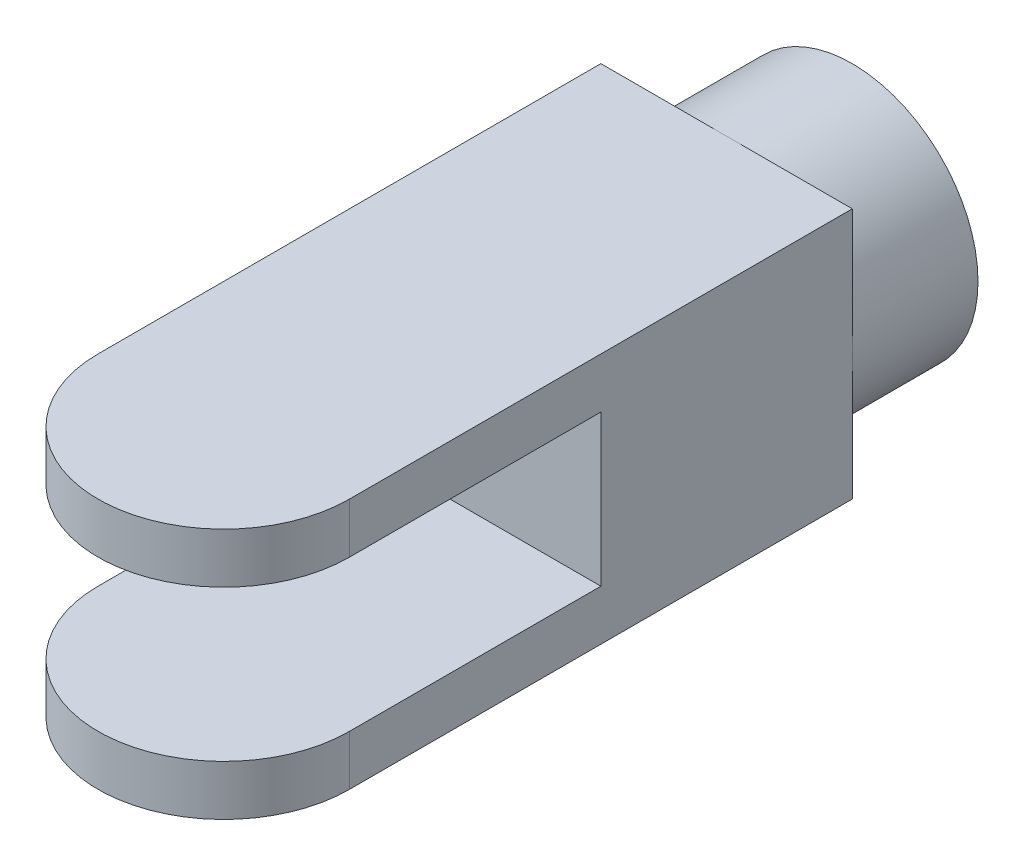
ISO-10303-21;
HEADER;
FILE_DESCRIPTION(('STEP AP214'),'2;1');
FILE_NAME('part.step','',(''),(''),'','','');
FILE_SCHEMA(('AUTOMOTIVE_DESIGN { 1 0 10303 214 1 1 1 1 }'));
ENDSEC;
DATA;
#1=APPLICATION_CONTEXT('core data for automotive mechanical design processes');
#2=APPLICATION_PROTOCOL_DEFINITION('international standard','automotive_design',2000,#1);
#3=PRODUCT_CONTEXT('',#1,'mechanical');
#4=PRODUCT('Part','Part','',(#3));
#5=PRODUCT_RELATED_PRODUCT_CATEGORY('part','',(#4));
#6=PRODUCT_DEFINITION_FORMATION('','',#4);
#7=PRODUCT_DEFINITION_CONTEXT('part definition',#1,'design');
#8=PRODUCT_DEFINITION('design','',#6,#7);
#9=PRODUCT_DEFINITION_SHAPE('','',#8);
#10=(LENGTH_UNIT() NAMED_UNIT(*) SI_UNIT(.MILLI.,.METRE.));
#11=(NAMED_UNIT(*) PLANE_ANGLE_UNIT() SI_UNIT($,.RADIAN.));
#12=(NAMED_UNIT(*) SI_UNIT($,.STERADIAN.) SOLID_ANGLE_UNIT());
#13=UNCERTAINTY_MEASURE_WITH_UNIT(LENGTH_MEASURE(1.E-05),#10,'distance_accuracy_value','');
#14=(GEOMETRIC_REPRESENTATION_CONTEXT(3) GLOBAL_UNCERTAINTY_ASSIGNED_CONTEXT((#13)) GLOBAL_UNIT_ASSIGNED_CONTEXT((#10,
#11,#12)) REPRESENTATION_CONTEXT('',''));
#15=CARTESIAN_POINT('',(0.,0.,0.));
#16=DIRECTION('',(0.,0.,1.));
#17=DIRECTION('',(1.,0.,0.));
#18=AXIS2_PLACEMENT_3D('',#15,#16,#17);
#19=CARTESIAN_POINT('',(0.,-50.,250.));
#20=DIRECTION('',(0.,1.,0.));
#21=DIRECTION('',(0.,0.,1.));
#22=AXIS2_PLACEMENT_3D('',#19,#20,#21);
#23=CYLINDRICAL_SURFACE('',#22,50.);
#24=CARTESIAN_POINT('',(0.,30.,250.));
#25=DIRECTION('',(0.,1.,0.));
#26=DIRECTION('',(0.,0.,1.));
#27=AXIS2_PLACEMENT_3D('',#24,#25,#26);
#28=CIRCLE('',#27,50.);
#29=CARTESIAN_POINT('',(50.,30.,250.));
#30=VERTEX_POINT('',#29);
#31=CARTESIAN_POINT('',(-50.,30.,250.));
#32=VERTEX_POINT('',#31);
#33=EDGE_CURVE('E121',#30,#32,#28,.F.);
#34=ORIENTED_EDGE('',*,*,#33,.F.);
#35=DIRECTION('',(0.,1.,0.));
#36=VECTOR('',#35,1.);
#37=CARTESIAN_POINT('',(50.,-50.,250.));
#38=LINE('',#37,#36);
#39=CARTESIAN_POINT('',(50.,50.,250.));
#40=VERTEX_POINT('',#39);
#41=EDGE_CURVE('E173',#30,#40,#38,.T.);
#42=ORIENTED_EDGE('',*,*,#41,.T.);
#43=CARTESIAN_POINT('',(0.,50.,250.));
#44=DIRECTION('',(0.,1.,0.));
#45=DIRECTION('',(0.,0.,1.));
#46=AXIS2_PLACEMENT_3D('',#43,#44,#45);
#47=CIRCLE('',#46,50.);
#48=CARTESIAN_POINT('',(-50.,50.,250.));
#49=VERTEX_POINT('',#48);
#50=EDGE_CURVE('E145',#49,#40,#47,.T.);
#51=ORIENTED_EDGE('',*,*,#50,.F.);
#52=DIRECTION('',(0.,1.,0.));
#53=VECTOR('',#52,1.);
#54=CARTESIAN_POINT('',(-50.,-50.,250.));
#55=LINE('',#54,#53);
#56=EDGE_CURVE('E176',#32,#49,#55,.T.);
#57=ORIENTED_EDGE('',*,*,#56,.F.);
#58=EDGE_LOOP('',(#34,#42,#51,#57));
#59=FACE_BOUND('',#58,.T.);
#60=ADVANCED_FACE('F32',(#59),#23,.T.);
#61=CARTESIAN_POINT('',(0.,0.,50.));
#62=DIRECTION('',(0.,0.,-1.));
#63=DIRECTION('',(-1.,0.,0.));
#64=AXIS2_PLACEMENT_3D('',#61,#62,#63);
#65=CYLINDRICAL_SURFACE('',#64,50.);
#66=CARTESIAN_POINT('',(0.,0.,50.));
#67=DIRECTION('',(0.,0.,1.));
#68=DIRECTION('',(1.,0.,0.));
#69=AXIS2_PLACEMENT_3D('',#66,#67,#68);
#70=CIRCLE('',#69,50.);
#71=CARTESIAN_POINT('',(50.,0.,50.));
#72=VERTEX_POINT('',#71);
#73=CARTESIAN_POINT('',(0.,50.,50.));
#74=VERTEX_POINT('',#73);
#75=EDGE_CURVE('E40',#72,#74,#70,.T.);
#76=ORIENTED_EDGE('',*,*,#75,.F.);
#77=CARTESIAN_POINT('',(0.,-50.,50.));
#78=VERTEX_POINT('',#77);
#79=EDGE_CURVE('E55',#78,#72,#70,.T.);
#80=ORIENTED_EDGE('',*,*,#79,.F.);
#81=CARTESIAN_POINT('',(-50.,0.,50.));
#82=VERTEX_POINT('',#81);
#83=EDGE_CURVE('E185',#82,#78,#70,.T.);
#84=ORIENTED_EDGE('',*,*,#83,.F.);
#85=EDGE_CURVE('E181',#74,#82,#70,.T.);
#86=ORIENTED_EDGE('',*,*,#85,.F.);
#87=EDGE_LOOP('',(#76,#80,#84,#86));
#88=FACE_BOUND('',#87,.T.);
#89=CARTESIAN_POINT('',(0.,0.,0.));
#90=DIRECTION('',(0.,0.,1.));
#91=DIRECTION('',(1.,0.,0.));
#92=AXIS2_PLACEMENT_3D('',#89,#90,#91);
#93=CIRCLE('',#92,50.);
#94=CARTESIAN_POINT('',(50.,0.,0.));
#95=VERTEX_POINT('',#94);
#96=EDGE_CURVE('E168',#95,#95,#93,.T.);
#97=ORIENTED_EDGE('',*,*,#96,.T.);
#98=EDGE_LOOP('',(#97));
#99=FACE_BOUND('',#98,.T.);
#100=ADVANCED_FACE('F34',(#88,#99),#65,.T.);
#101=CARTESIAN_POINT('',(0.,0.,0.));
#102=DIRECTION('',(0.,0.,1.));
#103=DIRECTION('',(1.,0.,0.));
#104=AXIS2_PLACEMENT_3D('',#101,#102,#103);
#105=PLANE('',#104);
#106=ORIENTED_EDGE('',*,*,#96,.F.);
#107=EDGE_LOOP('',(#106));
#108=FACE_BOUND('',#107,.T.);
#109=ADVANCED_FACE('F224',(#108),#105,.F.);
#110=CARTESIAN_POINT('',(-50.,-50.,50.));
#111=DIRECTION('',(0.,0.,-1.));
#112=DIRECTION('',(-1.,0.,0.));
#113=AXIS2_PLACEMENT_3D('',#110,#111,#112);
#114=PLANE('',#113);
#115=DIRECTION('',(0.,1.,0.));
#116=VECTOR('',#115,1.);
#117=CARTESIAN_POINT('',(50.,-50.,50.));
#118=LINE('',#117,#116);
#119=CARTESIAN_POINT('',(50.,50.,50.));
#120=VERTEX_POINT('',#119);
#121=EDGE_CURVE('E169',#72,#120,#118,.T.);
#122=ORIENTED_EDGE('',*,*,#121,.F.);
#123=ORIENTED_EDGE('',*,*,#75,.T.);
#124=DIRECTION('',(-1.,0.,0.));
#125=VECTOR('',#124,1.);
#126=CARTESIAN_POINT('',(-50.,50.,50.));
#127=LINE('',#126,#125);
#128=EDGE_CURVE('E139',#120,#74,#127,.T.);
#129=ORIENTED_EDGE('',*,*,#128,.F.);
#130=EDGE_LOOP('',(#122,#123,#129));
#131=FACE_BOUND('',#130,.T.);
#132=ADVANCED_FACE('F222',(#131),#114,.T.);
#133=CARTESIAN_POINT('',(-50.,50.,50.));
#134=VERTEX_POINT('',#133);
#135=EDGE_CURVE('E138',#74,#134,#127,.T.);
#136=ORIENTED_EDGE('',*,*,#135,.F.);
#137=ORIENTED_EDGE('',*,*,#85,.T.);
#138=DIRECTION('',(0.,1.,0.));
#139=VECTOR('',#138,1.);
#140=CARTESIAN_POINT('',(-50.,-50.,50.));
#141=LINE('',#140,#139);
#142=EDGE_CURVE('E164',#82,#134,#141,.T.);
#143=ORIENTED_EDGE('',*,*,#142,.T.);
#144=EDGE_LOOP('',(#136,#137,#143));
#145=FACE_BOUND('',#144,.T.);
#146=ADVANCED_FACE('F195',(#145),#114,.T.);
#147=CARTESIAN_POINT('',(-50.,-50.,50.));
#148=VERTEX_POINT('',#147);
#149=EDGE_CURVE('E177',#148,#82,#141,.T.);
#150=ORIENTED_EDGE('',*,*,#149,.T.);
#151=ORIENTED_EDGE('',*,*,#83,.T.);
#152=DIRECTION('',(-1.,0.,0.));
#153=VECTOR('',#152,1.);
#154=CARTESIAN_POINT('',(-50.,-50.,50.));
#155=LINE('',#154,#153);
#156=EDGE_CURVE('E151',#78,#148,#155,.T.);
#157=ORIENTED_EDGE('',*,*,#156,.T.);
#158=EDGE_LOOP('',(#150,#151,#157));
#159=FACE_BOUND('',#158,.T.);
#160=ADVANCED_FACE('F199',(#159),#114,.T.);
#161=CARTESIAN_POINT('',(50.,-50.,50.));
#162=VERTEX_POINT('',#161);
#163=EDGE_CURVE('E152',#162,#78,#155,.T.);
#164=ORIENTED_EDGE('',*,*,#163,.T.);
#165=ORIENTED_EDGE('',*,*,#79,.T.);
#166=EDGE_CURVE('E165',#162,#72,#118,.T.);
#167=ORIENTED_EDGE('',*,*,#166,.F.);
#168=EDGE_LOOP('',(#164,#165,#167));
#169=FACE_BOUND('',#168,.T.);
#170=ADVANCED_FACE('F205',(#169),#114,.T.);
#171=CARTESIAN_POINT('',(50.,-50.,50.));
#172=DIRECTION('',(1.,0.,0.));
#173=DIRECTION('',(0.,0.,-1.));
#174=AXIS2_PLACEMENT_3D('',#171,#172,#173);
#175=PLANE('',#174);
#176=DIRECTION('',(0.,0.,1.));
#177=VECTOR('',#176,1.);
#178=CARTESIAN_POINT('',(50.,30.,300.));
#179=LINE('',#178,#177);
#180=CARTESIAN_POINT('',(50.,30.,150.));
#181=VERTEX_POINT('',#180);
#182=EDGE_CURVE('E128',#181,#30,#179,.T.);
#183=ORIENTED_EDGE('',*,*,#182,.F.);
#184=DIRECTION('',(0.,1.,0.));
#185=VECTOR('',#184,1.);
#186=CARTESIAN_POINT('',(50.,30.,150.));
#187=LINE('',#186,#185);
#188=CARTESIAN_POINT('',(50.,-30.,150.));
#189=VERTEX_POINT('',#188);
#190=EDGE_CURVE('E111',#189,#181,#187,.T.);
#191=ORIENTED_EDGE('',*,*,#190,.F.);
#192=DIRECTION('',(0.,0.,-1.));
#193=VECTOR('',#192,1.);
#194=CARTESIAN_POINT('',(50.,-30.,300.));
#195=LINE('',#194,#193);
#196=CARTESIAN_POINT('',(50.,-30.,250.));
#197=VERTEX_POINT('',#196);
#198=EDGE_CURVE('E132',#197,#189,#195,.T.);
#199=ORIENTED_EDGE('',*,*,#198,.F.);
#200=CARTESIAN_POINT('',(50.,-50.,250.));
#201=VERTEX_POINT('',#200);
#202=EDGE_CURVE('E170',#201,#197,#38,.T.);
#203=ORIENTED_EDGE('',*,*,#202,.F.);
#204=DIRECTION('',(0.,0.,-1.));
#205=VECTOR('',#204,1.);
#206=CARTESIAN_POINT('',(50.,-50.,50.));
#207=LINE('',#206,#205);
#208=EDGE_CURVE('E161',#201,#162,#207,.T.);
#209=ORIENTED_EDGE('',*,*,#208,.T.);
#210=ORIENTED_EDGE('',*,*,#166,.T.);
#211=ORIENTED_EDGE('',*,*,#121,.T.);
#212=DIRECTION('',(0.,0.,-1.));
#213=VECTOR('',#212,1.);
#214=CARTESIAN_POINT('',(50.,50.,50.));
#215=LINE('',#214,#213);
#216=EDGE_CURVE('E148',#40,#120,#215,.T.);
#217=ORIENTED_EDGE('',*,*,#216,.F.);
#218=ORIENTED_EDGE('',*,*,#41,.F.);
#219=EDGE_LOOP('',(#183,#191,#199,#203,#209,#210,#211,#217,#218));
#220=FACE_BOUND('',#219,.T.);
#221=ADVANCED_FACE('F207',(#220),#175,.T.);
#222=CARTESIAN_POINT('',(0.,-30.,250.));
#223=DIRECTION('',(0.,-1.,0.));
#224=DIRECTION('',(0.,0.,-1.));
#225=AXIS2_PLACEMENT_3D('',#222,#223,#224);
#226=CIRCLE('',#225,50.);
#227=CARTESIAN_POINT('',(-50.,-30.,250.));
#228=VERTEX_POINT('',#227);
#229=EDGE_CURVE('E115',#228,#197,#226,.F.);
#230=ORIENTED_EDGE('',*,*,#229,.F.);
#231=CARTESIAN_POINT('',(-50.,-50.,250.));
#232=VERTEX_POINT('',#231);
#233=EDGE_CURVE('E174',#232,#228,#55,.T.);
#234=ORIENTED_EDGE('',*,*,#233,.F.);
#235=CARTESIAN_POINT('',(0.,-50.,250.));
#236=DIRECTION('',(0.,1.,0.));
#237=DIRECTION('',(0.,0.,1.));
#238=AXIS2_PLACEMENT_3D('',#235,#236,#237);
#239=CIRCLE('',#238,50.);
#240=EDGE_CURVE('E158',#232,#201,#239,.T.);
#241=ORIENTED_EDGE('',*,*,#240,.T.);
#242=ORIENTED_EDGE('',*,*,#202,.T.);
#243=EDGE_LOOP('',(#230,#234,#241,#242));
#244=FACE_BOUND('',#243,.T.);
#245=ADVANCED_FACE('F212',(#244),#23,.T.);
#246=CARTESIAN_POINT('',(-50.,-50.,50.));
#247=DIRECTION('',(-1.,0.,0.));
#248=DIRECTION('',(0.,0.,1.));
#249=AXIS2_PLACEMENT_3D('',#246,#247,#248);
#250=PLANE('',#249);
#251=DIRECTION('',(0.,0.,1.));
#252=VECTOR('',#251,1.);
#253=CARTESIAN_POINT('',(-50.,30.,300.));
#254=LINE('',#253,#252);
#255=CARTESIAN_POINT('',(-50.,30.,150.));
#256=VERTEX_POINT('',#255);
#257=EDGE_CURVE('E119',#256,#32,#254,.T.);
#258=ORIENTED_EDGE('',*,*,#257,.T.);
#259=ORIENTED_EDGE('',*,*,#56,.T.);
#260=DIRECTION('',(0.,0.,1.));
#261=VECTOR('',#260,1.);
#262=CARTESIAN_POINT('',(-50.,50.,50.));
#263=LINE('',#262,#261);
#264=EDGE_CURVE('E142',#134,#49,#263,.T.);
#265=ORIENTED_EDGE('',*,*,#264,.F.);
#266=ORIENTED_EDGE('',*,*,#142,.F.);
#267=ORIENTED_EDGE('',*,*,#149,.F.);
#268=DIRECTION('',(0.,0.,1.));
#269=VECTOR('',#268,1.);
#270=CARTESIAN_POINT('',(-50.,-50.,50.));
#271=LINE('',#270,#269);
#272=EDGE_CURVE('E155',#148,#232,#271,.T.);
#273=ORIENTED_EDGE('',*,*,#272,.T.);
#274=ORIENTED_EDGE('',*,*,#233,.T.);
#275=DIRECTION('',(0.,0.,1.));
#276=VECTOR('',#275,1.);
#277=CARTESIAN_POINT('',(-50.,-30.,50.));
#278=LINE('',#277,#276);
#279=CARTESIAN_POINT('',(-50.,-30.,150.));
#280=VERTEX_POINT('',#279);
#281=EDGE_CURVE('E11',#280,#228,#278,.T.);
#282=ORIENTED_EDGE('',*,*,#281,.F.);
#283=DIRECTION('',(0.,1.,0.));
#284=VECTOR('',#283,1.);
#285=CARTESIAN_POINT('',(-50.,30.,150.));
#286=LINE('',#285,#284);
#287=EDGE_CURVE('E47',#280,#256,#286,.T.);
#288=ORIENTED_EDGE('',*,*,#287,.T.);
#289=EDGE_LOOP('',(#258,#259,#265,#266,#267,#273,#274,#282,#288));
#290=FACE_BOUND('',#289,.T.);
#291=ADVANCED_FACE('F126',(#290),#250,.T.);
#292=CARTESIAN_POINT('',(0.,-50.,250.));
#293=DIRECTION('',(0.,1.,0.));
#294=DIRECTION('',(0.,0.,1.));
#295=AXIS2_PLACEMENT_3D('',#292,#293,#294);
#296=PLANE('',#295);
#297=ORIENTED_EDGE('',*,*,#163,.F.);
#298=ORIENTED_EDGE('',*,*,#208,.F.);
#299=ORIENTED_EDGE('',*,*,#240,.F.);
#300=ORIENTED_EDGE('',*,*,#272,.F.);
#301=ORIENTED_EDGE('',*,*,#156,.F.);
#302=EDGE_LOOP('',(#297,#298,#299,#300,#301));
#303=FACE_BOUND('',#302,.T.);
#304=ADVANCED_FACE('F202',(#303),#296,.F.);
#305=CARTESIAN_POINT('',(0.,50.,250.));
#306=DIRECTION('',(0.,1.,0.));
#307=DIRECTION('',(0.,0.,1.));
#308=AXIS2_PLACEMENT_3D('',#305,#306,#307);
#309=PLANE('',#308);
#310=ORIENTED_EDGE('',*,*,#128,.T.);
#311=ORIENTED_EDGE('',*,*,#135,.T.);
#312=ORIENTED_EDGE('',*,*,#264,.T.);
#313=ORIENTED_EDGE('',*,*,#50,.T.);
#314=ORIENTED_EDGE('',*,*,#216,.T.);
#315=EDGE_LOOP('',(#310,#311,#312,#313,#314));
#316=FACE_BOUND('',#315,.T.);
#317=ADVANCED_FACE('F219',(#316),#309,.T.);
#318=CARTESIAN_POINT('',(-50.,30.,300.));
#319=DIRECTION('',(0.,1.,0.));
#320=DIRECTION('',(0.,0.,1.));
#321=AXIS2_PLACEMENT_3D('',#318,#319,#320);
#322=PLANE('',#321);
#323=ORIENTED_EDGE('',*,*,#33,.T.);
#324=ORIENTED_EDGE('',*,*,#257,.F.);
#325=DIRECTION('',(1.,0.,0.));
#326=VECTOR('',#325,1.);
#327=CARTESIAN_POINT('',(-50.,30.,150.));
#328=LINE('',#327,#326);
#329=EDGE_CURVE('E107',#256,#181,#328,.T.);
#330=ORIENTED_EDGE('',*,*,#329,.T.);
#331=ORIENTED_EDGE('',*,*,#182,.T.);
#332=EDGE_LOOP('',(#323,#324,#330,#331));
#333=FACE_BOUND('',#332,.T.);
#334=ADVANCED_FACE('F120',(#333),#322,.F.);
#335=CARTESIAN_POINT('',(-50.,30.,150.));
#336=DIRECTION('',(0.,0.,-1.));
#337=DIRECTION('',(-1.,0.,0.));
#338=AXIS2_PLACEMENT_3D('',#335,#336,#337);
#339=PLANE('',#338);
#340=ORIENTED_EDGE('',*,*,#190,.T.);
#341=ORIENTED_EDGE('',*,*,#329,.F.);
#342=ORIENTED_EDGE('',*,*,#287,.F.);
#343=DIRECTION('',(1.,0.,0.));
#344=VECTOR('',#343,1.);
#345=CARTESIAN_POINT('',(-50.,-30.,150.));
#346=LINE('',#345,#344);
#347=EDGE_CURVE('E116',#280,#189,#346,.T.);
#348=ORIENTED_EDGE('',*,*,#347,.T.);
#349=EDGE_LOOP('',(#340,#341,#342,#348));
#350=FACE_BOUND('',#349,.T.);
#351=ADVANCED_FACE('F109',(#350),#339,.F.);
#352=CARTESIAN_POINT('',(-50.,-30.,300.));
#353=DIRECTION('',(0.,-1.,0.));
#354=DIRECTION('',(0.,0.,-1.));
#355=AXIS2_PLACEMENT_3D('',#352,#353,#354);
#356=PLANE('',#355);
#357=ORIENTED_EDGE('',*,*,#229,.T.);
#358=ORIENTED_EDGE('',*,*,#198,.T.);
#359=ORIENTED_EDGE('',*,*,#347,.F.);
#360=ORIENTED_EDGE('',*,*,#281,.T.);
#361=EDGE_LOOP('',(#357,#358,#359,#360));
#362=FACE_BOUND('',#361,.T.);
#363=ADVANCED_FACE('F214',(#362),#356,.F.);
#364=CLOSED_SHELL('',(#60,#100,#109,#132,#146,#160,#170,#221,#245,#291,#304,#317,#334,#351,#363));
#365=MANIFOLD_SOLID_BREP('B2',#364);
#366=ADVANCED_BREP_SHAPE_REPRESENTATION('',(#18,#365),#14);
#367=SHAPE_DEFINITION_REPRESENTATION(#9,#366);
ENDSEC;
END-ISO-10303-21;
